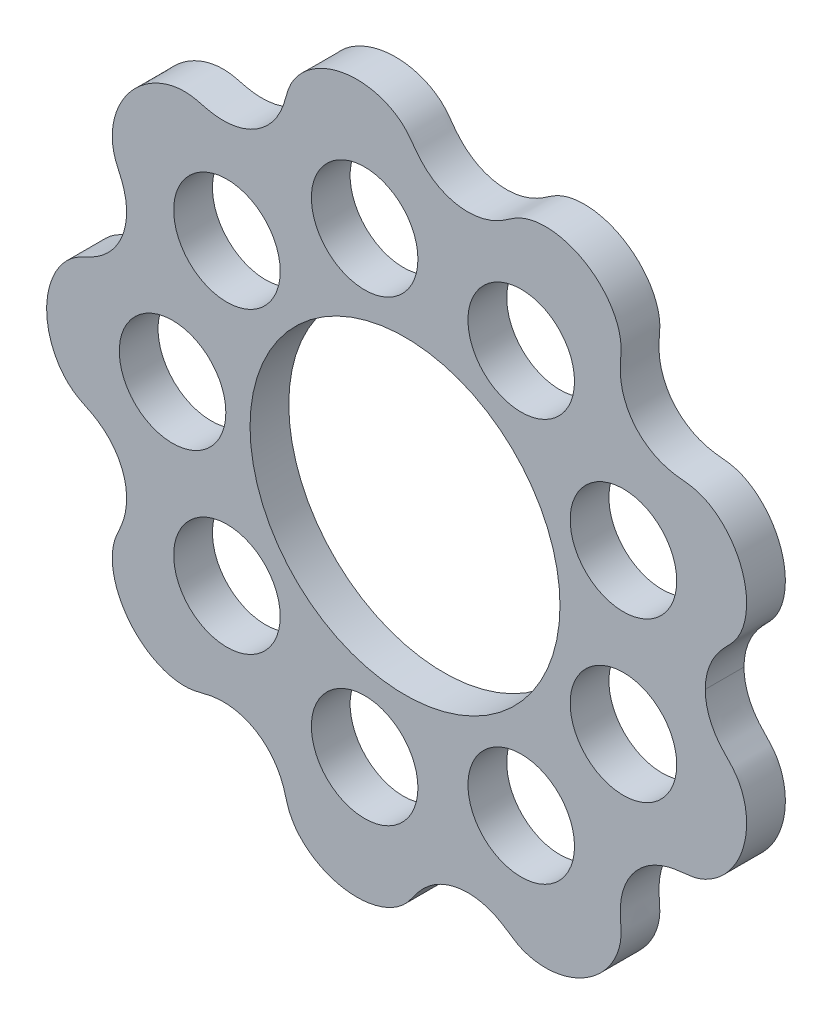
from build123d import *

# Parameters (mm, degrees)
BOSS_EXTRUDE1_DEPTH = 12.7
SKETCH2_R           = 101.6127
SKETCH2_R_2         = 34.925
CUT_EXTRUDE1_DEPTH  = 332.298667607


with BuildPart() as part:
    # Sketch1 → Boss-Extrude1 (new, symmetric)
    with BuildSketch(Plane.XY):
        with BuildLine():
            add(Edge.make_bspline(
                [(196.85000103, 0), (196.850001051, -0.046039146), (196.852222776, -1.512943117), (196.995909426, -4.400396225), (197.618960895, -8.675591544), (199.214953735, -14.144281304), (201.436535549, -19.105433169), (204.121217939, -23.525471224), (206.757870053, -26.958499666), (209.077423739, -29.560459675), (211.092774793, -31.650617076), (212.721954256, -33.306011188), (214.404150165, -35.088807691), (216.060981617, -37.067492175), (217.629453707, -39.277126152), (219.072825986, -41.719892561), (220.364838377, -44.361114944), (221.487205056, -47.190189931), (222.664010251, -50.970777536), (223.602165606, -55.549875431), (224.087110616, -60.811877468), (223.921999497, -66.698037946), (223.13999542, -72.325311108), (221.757628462, -77.843299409), (219.794894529, -83.19043027), (217.271233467, -88.305461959), (214.206353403, -93.125172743), (210.504320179, -97.729096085), (206.714378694, -101.425642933), (203.027640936, -104.299747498), (199.680219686, -106.408116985), (196.985140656, -107.830553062), (194.277062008, -108.999523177), (191.576680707, -109.917517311), (188.918777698, -110.576327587), (186.330507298, -111.002411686), (183.243105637, -111.3367641), (179.669117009, -111.664277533), (176.111995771, -112.171948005), (172.605356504, -112.954650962), (168.942274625, -114.042132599), (165.157269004, -115.498760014), (160.806658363, -117.741293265), (156.126056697, -121.042339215), (151.966710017, -124.951893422), (148.407198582, -129.388969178), (145.51103413, -134.25723107), (143.319881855, -139.454904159), (141.915943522, -144.657877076), (141.197922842, -149.74161015), (141.055999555, -154.042391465), (141.187629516, -157.511769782), (141.39855003, -160.396104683), (141.578839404, -162.702602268), (141.699883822, -165.137580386), (141.664613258, -167.700425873), (141.414252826, -170.376223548), (140.923371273, -173.143814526), (140.191768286, -175.975447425), (139.209293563, -178.85109158), (137.646201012, -182.500357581), (135.386029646, -186.595401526), (132.350457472, -190.902205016), (128.432805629, -195.2533265), (124.237150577, -199.000537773), (119.625722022, -202.311858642), (114.643228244, -205.140711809), (109.337063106, -207.438263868), (103.759619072, -209.152059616), (97.915750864, -210.243192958), (92.654041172, -210.576006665), (88.065239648, -210.360710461), (84.244936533, -209.80600014), (81.295093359, -209.147047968), (78.45828108, -208.274419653), (75.753329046, -207.192052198), (73.27402234, -205.940361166), (71.020299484, -204.567040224), (68.949609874, -203.164574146), (67.000408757, -201.826373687), (65.024474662, -200.527294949), (63.003869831, -199.298259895), (60.413774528, -197.872498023), (56.950969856, -196.247537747), (52.524985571, -194.669432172), (47.078229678, -193.488964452), (41.241957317, -193.068438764), (35.472845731, -193.4810331), (29.887183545, -194.689911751), (24.592101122, -196.636786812), (19.673658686, -199.248451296), (15.344976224, -202.348523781), (11.605509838, -205.781955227), (8.788513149, -208.975293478), (6.69499513, -211.704553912), (5.023606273, -214.031937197), (3.688079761, -215.895000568), (2.218248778, -217.8086772), (0.547121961, -219.713724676), (-1.354788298, -221.565646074), (-3.492071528, -223.33411665), (-6.465692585, -225.436027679), (-10.396610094, -227.657291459), (-15.209727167, -229.66474607), (-20.907566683, -231.219963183), (-26.572837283, -232.075047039), (-32.122703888, -232.308629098), (-37.679181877, -231.957730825), (-43.181983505, -231.028778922), (-48.570850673, -229.527800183), (-53.783476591, -227.460747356), (-58.944429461, -224.735242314), (-63.937483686, -221.286781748), (-67.916556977, -217.678658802), (-70.960921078, -214.144706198), (-73.089809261, -211.082457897), (-74.508187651, -208.666399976), (-75.671506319, -206.253324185), (-76.59512018, -203.871074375), (-77.32404683, -201.552464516), (-77.944504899, -199.33101765), (-78.725284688, -196.555650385), (-79.770711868, -193.25624843), (-81.347163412, -189.267084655), (-83.722345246, -184.734207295), (-86.778183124, -180.31666964), (-90.568961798, -176.164576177), (-94.925849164, -172.541671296), (-99.782095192, -169.536998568), (-105.049141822, -167.229418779), (-110.626794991, -165.678711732), (-116.096779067, -164.956543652), (-120.751060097, -164.939869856), (-124.526704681, -165.286867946), (-127.425240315, -165.741049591), (-129.726184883, -166.203169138), (-132.009439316, -166.74468554), (-134.281244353, -167.330960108), (-136.686197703, -167.935329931), (-139.249508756, -168.451876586), (-141.97957417, -168.781348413), (-144.860848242, -168.879485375), (-147.832687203, -168.7382657), (-150.875659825, -168.35005899), (-154.766432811, -167.543813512), (-159.248821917, -166.131164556), (-164.123762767, -163.970580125), (-169.2374328, -160.911658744), (-173.828925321, -157.41204928), (-177.995538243, -153.447575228), (-181.699351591, -149.076023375), (-184.904191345, -144.352373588), (-187.574018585, -139.33075548), (-189.732868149, -133.902900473), (-191.072024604, -128.868430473), (-191.76501325, -124.34917411), (-191.981321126, -120.497913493), (-191.928744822, -117.504503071), (-191.657191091, -114.599860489), (-191.173278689, -111.800386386), (-190.490617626, -109.172847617), (-189.640990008, -106.728902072), (-188.686125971, -104.462523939), (-187.719898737, -102.340207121), (-186.526313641, -99.680754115), (-185.208429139, -96.438881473), (-183.866314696, -92.310337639), (-182.80738555, -87.236912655), (-182.366190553, -81.810721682), (-182.684461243, -76.117564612), (-183.794267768, -70.502413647), (-185.688687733, -65.078420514), (-188.337081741, -59.961444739), (-191.688985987, -55.255656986), (-195.477371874, -51.255591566), (-199.075858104, -48.311628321), (-202.221888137, -46.197959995), (-204.7560087, -44.715268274), (-206.829796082, -43.612974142), (-208.936590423, -42.57582629), (-211.056835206, -41.56729591), (-213.277741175, -40.463466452), (-215.54763616, -39.168191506), (-217.815527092, -37.619330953), (-220.045450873, -35.800549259), (-222.16976175, -33.764127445), (-224.174368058, -31.521442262), (-226.523998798, -28.461264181), (-228.950876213, -24.574502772), (-231.226758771, -19.85416145), (-233.132309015, -14.277928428), (-234.375362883, -8.652496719), (-234.844405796, -4.346077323), (-234.949590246, -1.460038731), (-234.950000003, -0.011331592), (-234.950000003, 0)],
                knots=[0.122725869, 0.122725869, 0.122725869, 0.122725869, 0.122725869, 0.122903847, 0.128396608, 0.133889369, 0.139372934, 0.144856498, 0.14934603, 0.153835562, 0.156080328, 0.158325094, 0.160569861, 0.162814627, 0.165553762, 0.168292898, 0.171032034, 0.17377117, 0.176909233, 0.180047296, 0.186323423, 0.191803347, 0.197283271, 0.202763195, 0.208243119, 0.21375214, 0.21926116, 0.22477018, 0.2302792, 0.236541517, 0.239672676, 0.242803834, 0.245557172, 0.24831051, 0.251063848, 0.253817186, 0.256129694, 0.258442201, 0.263067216, 0.267692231, 0.270004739, 0.272317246, 0.27783198, 0.283346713, 0.288866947, 0.294387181, 0.2998262, 0.30526522, 0.310695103, 0.316124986, 0.320596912, 0.325068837, 0.3273048, 0.329540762, 0.331776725, 0.334012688, 0.336726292, 0.339439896, 0.3421535, 0.344867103, 0.348021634, 0.351176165, 0.357485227, 0.362911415, 0.368337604, 0.373763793, 0.379189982, 0.384817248, 0.390444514, 0.39607178, 0.401699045, 0.407747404, 0.410771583, 0.413795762, 0.416608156, 0.419420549, 0.422232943, 0.425045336, 0.427330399, 0.429615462, 0.431900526, 0.434185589, 0.436470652, 0.438755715, 0.443325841, 0.448958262, 0.454590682, 0.460230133, 0.465869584, 0.471240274, 0.476610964, 0.481971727, 0.487332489, 0.491763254, 0.49619402, 0.498409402, 0.500624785, 0.502840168, 0.505055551, 0.507733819, 0.510412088, 0.513090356, 0.515768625, 0.521798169, 0.527827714, 0.53318598, 0.538544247, 0.543902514, 0.54926078, 0.554669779, 0.560078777, 0.565487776, 0.570896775, 0.577186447, 0.583476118, 0.586180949, 0.58888578, 0.59159061, 0.594295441, 0.596524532, 0.598753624, 0.600982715, 0.603211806, 0.607669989, 0.612128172, 0.617539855, 0.622951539, 0.628373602, 0.633795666, 0.639375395, 0.644955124, 0.650528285, 0.656101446, 0.660636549, 0.662904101, 0.665171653, 0.667439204, 0.669706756, 0.671974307, 0.674241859, 0.677024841, 0.679807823, 0.682590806, 0.685373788, 0.688514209, 0.69165463, 0.697935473, 0.703503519, 0.709071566, 0.714639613, 0.72020766, 0.725693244, 0.731178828, 0.736664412, 0.742149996, 0.748227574, 0.751266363, 0.754305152, 0.757047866, 0.75979058, 0.762533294, 0.765276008, 0.767529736, 0.769783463, 0.77203719, 0.774290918, 0.778798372, 0.783305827, 0.78879334, 0.794280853, 0.799779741, 0.80527863, 0.810847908, 0.816417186, 0.821978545, 0.827539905, 0.832078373, 0.834347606, 0.83661684, 0.838886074, 0.841155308, 0.843424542, 0.845693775, 0.84847169, 0.851249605, 0.85402752, 0.856805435, 0.859836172, 0.86286691, 0.868928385, 0.874484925, 0.880041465, 0.885598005, 0.891154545, 0.891198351, 0.891198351, 0.891198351, 0.891198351, 0.891198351], degree=4))
            add(Edge.make_bspline(
                [(196.85000103, 0), (196.850001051, 0.046039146), (196.852222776, 1.512943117), (196.995909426, 4.400396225), (197.618960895, 8.675591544), (199.214953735, 14.144281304), (201.436535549, 19.105433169), (204.121217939, 23.525471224), (206.757870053, 26.958499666), (209.077423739, 29.560459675), (211.092774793, 31.650617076), (212.721954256, 33.306011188), (214.404150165, 35.088807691), (216.060981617, 37.067492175), (217.629453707, 39.277126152), (219.072825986, 41.719892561), (220.364838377, 44.361114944), (221.487205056, 47.190189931), (222.664010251, 50.970777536), (223.602165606, 55.549875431), (224.087110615, 60.811877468), (223.921999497, 66.698037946), (223.13999542, 72.325311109), (221.757628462, 77.843299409), (219.794894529, 83.19043027), (217.271233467, 88.305461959), (214.206353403, 93.125172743), (210.504320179, 97.729096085), (206.714378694, 101.425642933), (203.027640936, 104.299747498), (199.680219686, 106.408116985), (196.985140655, 107.830553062), (194.277062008, 108.999523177), (191.576680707, 109.917517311), (188.918777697, 110.576327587), (186.330507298, 111.002411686), (183.243105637, 111.3367641), (179.669117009, 111.664277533), (176.111995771, 112.171948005), (172.605356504, 112.954650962), (168.942274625, 114.042132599), (165.157269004, 115.498760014), (160.806658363, 117.741293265), (156.126056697, 121.042339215), (151.966710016, 124.951893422), (148.407198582, 129.388969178), (145.51103413, 134.25723107), (143.319881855, 139.454904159), (141.915943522, 144.657877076), (141.197922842, 149.74161015), (141.055999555, 154.042391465), (141.187629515, 157.511769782), (141.39855003, 160.396104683), (141.578839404, 162.702602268), (141.699883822, 165.137580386), (141.664613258, 167.700425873), (141.414252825, 170.376223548), (140.923371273, 173.143814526), (140.191768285, 175.975447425), (139.209293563, 178.851091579), (137.646201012, 182.500357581), (135.386029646, 186.595401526), (132.350457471, 190.902205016), (128.432805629, 195.2533265), (124.237150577, 199.000537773), (119.625722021, 202.311858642), (114.643228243, 205.140711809), (109.337063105, 207.438263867), (103.759619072, 209.152059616), (97.915750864, 210.243192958), (92.654041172, 210.576006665), (88.065239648, 210.360710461), (84.244936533, 209.80600014), (81.295093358, 209.147047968), (78.45828108, 208.274419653), (75.753329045, 207.192052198), (73.27402234, 205.940361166), (71.020299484, 204.567040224), (68.949609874, 203.164574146), (67.000408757, 201.826373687), (65.024474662, 200.527294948), (63.00386983, 199.298259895), (60.413774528, 197.872498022), (56.950969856, 196.247537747), (52.524985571, 194.669432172), (47.078229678, 193.488964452), (41.241957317, 193.068438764), (35.472845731, 193.4810331), (29.887183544, 194.689911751), (24.592101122, 196.636786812), (19.673658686, 199.248451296), (15.344976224, 202.34852378), (11.605509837, 205.781955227), (8.788513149, 208.975293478), (6.694995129, 211.704553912), (5.023606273, 214.031937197), (3.688079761, 215.895000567), (2.218248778, 217.8086772), (0.54712196, 219.713724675), (-1.354788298, 221.565646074), (-3.492071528, 223.33411665), (-6.465692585, 225.436027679), (-10.396610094, 227.657291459), (-15.209727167, 229.66474607), (-20.907566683, 231.219963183), (-26.572837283, 232.075047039), (-32.122703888, 232.308629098), (-37.679181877, 231.957730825), (-43.181983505, 231.028778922), (-48.570850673, 229.527800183), (-53.783476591, 227.460747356), (-58.944429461, 224.735242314), (-63.937483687, 221.286781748), (-67.916556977, 217.678658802), (-70.960921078, 214.144706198), (-73.089809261, 211.082457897), (-74.508187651, 208.666399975), (-75.671506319, 206.253324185), (-76.59512018, 203.871074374), (-77.32404683, 201.552464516), (-77.9445049, 199.331017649), (-78.725284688, 196.555650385), (-79.770711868, 193.25624843), (-81.347163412, 189.267084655), (-83.722345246, 184.734207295), (-86.778183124, 180.31666964), (-90.568961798, 176.164576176), (-94.925849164, 172.541671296), (-99.782095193, 169.536998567), (-105.049141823, 167.229418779), (-110.626794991, 165.678711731), (-116.096779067, 164.956543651), (-120.751060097, 164.939869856), (-124.526704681, 165.286867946), (-127.425240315, 165.741049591), (-129.726184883, 166.203169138), (-132.009439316, 166.74468554), (-134.281244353, 167.330960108), (-136.686197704, 167.935329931), (-139.249508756, 168.451876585), (-141.97957417, 168.781348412), (-144.860848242, 168.879485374), (-147.832687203, 168.738265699), (-150.875659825, 168.35005899), (-154.766432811, 167.543813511), (-159.248821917, 166.131164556), (-164.123762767, 163.970580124), (-169.2374328, 160.911658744), (-173.828925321, 157.41204928), (-177.995538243, 153.447575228), (-181.699351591, 149.076023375), (-184.904191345, 144.352373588), (-187.574018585, 139.33075548), (-189.732868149, 133.902900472), (-191.072024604, 128.868430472), (-191.76501325, 124.349174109), (-191.981321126, 120.497913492), (-191.928744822, 117.504503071), (-191.657191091, 114.599860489), (-191.173278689, 111.800386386), (-190.490617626, 109.172847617), (-189.640990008, 106.728902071), (-188.686125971, 104.462523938), (-187.719898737, 102.340207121), (-186.526313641, 99.680754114), (-185.208429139, 96.438881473), (-183.866314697, 92.310337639), (-182.80738555, 87.236912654), (-182.366190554, 81.810721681), (-182.684461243, 76.117564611), (-183.794267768, 70.502413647), (-185.688687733, 65.078420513), (-188.337081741, 59.961444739), (-191.688985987, 55.255656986), (-195.477371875, 51.255591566), (-199.075858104, 48.31162832), (-202.221888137, 46.197959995), (-204.7560087, 44.715268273), (-206.829796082, 43.612974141), (-208.936590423, 42.575826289), (-211.056835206, 41.567295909), (-213.277741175, 40.463466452), (-215.54763616, 39.168191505), (-217.815527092, 37.619330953), (-220.045450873, 35.800549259), (-222.16976175, 33.764127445), (-224.174368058, 31.521442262), (-226.523998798, 28.461264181), (-228.950876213, 24.574502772), (-231.226758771, 19.85416145), (-233.132309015, 14.277928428), (-234.375362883, 8.652496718), (-234.844405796, 4.346077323), (-234.949590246, 1.46003873), (-234.950000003, 0.011331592), (-234.950000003, 0)],
                knots=[0.122725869, 0.122725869, 0.122725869, 0.122725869, 0.122725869, 0.122903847, 0.128396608, 0.133889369, 0.139372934, 0.144856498, 0.14934603, 0.153835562, 0.156080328, 0.158325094, 0.160569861, 0.162814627, 0.165553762, 0.168292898, 0.171032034, 0.17377117, 0.176909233, 0.180047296, 0.186323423, 0.191803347, 0.197283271, 0.202763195, 0.208243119, 0.21375214, 0.21926116, 0.22477018, 0.2302792, 0.236541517, 0.239672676, 0.242803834, 0.245557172, 0.24831051, 0.251063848, 0.253817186, 0.256129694, 0.258442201, 0.263067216, 0.267692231, 0.270004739, 0.272317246, 0.27783198, 0.283346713, 0.288866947, 0.294387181, 0.2998262, 0.30526522, 0.310695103, 0.316124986, 0.320596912, 0.325068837, 0.3273048, 0.329540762, 0.331776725, 0.334012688, 0.336726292, 0.339439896, 0.3421535, 0.344867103, 0.348021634, 0.351176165, 0.357485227, 0.362911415, 0.368337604, 0.373763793, 0.379189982, 0.384817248, 0.390444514, 0.39607178, 0.401699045, 0.407747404, 0.410771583, 0.413795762, 0.416608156, 0.419420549, 0.422232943, 0.425045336, 0.427330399, 0.429615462, 0.431900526, 0.434185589, 0.436470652, 0.438755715, 0.443325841, 0.448958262, 0.454590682, 0.460230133, 0.465869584, 0.471240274, 0.476610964, 0.481971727, 0.487332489, 0.491763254, 0.49619402, 0.498409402, 0.500624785, 0.502840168, 0.505055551, 0.507733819, 0.510412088, 0.513090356, 0.515768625, 0.521798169, 0.527827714, 0.53318598, 0.538544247, 0.543902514, 0.54926078, 0.554669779, 0.560078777, 0.565487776, 0.570896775, 0.577186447, 0.583476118, 0.586180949, 0.58888578, 0.59159061, 0.594295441, 0.596524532, 0.598753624, 0.600982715, 0.603211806, 0.607669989, 0.612128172, 0.617539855, 0.622951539, 0.628373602, 0.633795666, 0.639375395, 0.644955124, 0.650528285, 0.656101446, 0.660636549, 0.662904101, 0.665171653, 0.667439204, 0.669706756, 0.671974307, 0.674241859, 0.677024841, 0.679807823, 0.682590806, 0.685373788, 0.688514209, 0.69165463, 0.697935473, 0.703503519, 0.709071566, 0.714639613, 0.72020766, 0.725693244, 0.731178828, 0.736664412, 0.742149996, 0.748227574, 0.751266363, 0.754305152, 0.757047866, 0.75979058, 0.762533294, 0.765276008, 0.767529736, 0.769783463, 0.77203719, 0.774290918, 0.778798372, 0.783305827, 0.78879334, 0.794280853, 0.799779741, 0.80527863, 0.810847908, 0.816417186, 0.821978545, 0.827539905, 0.832078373, 0.834347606, 0.83661684, 0.838886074, 0.841155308, 0.843424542, 0.845693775, 0.84847169, 0.851249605, 0.85402752, 0.856805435, 0.859836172, 0.86286691, 0.868928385, 0.874484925, 0.880041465, 0.885598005, 0.891154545, 0.891198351, 0.891198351, 0.891198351, 0.891198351, 0.891198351], degree=4))
        make_face()
    extrude(amount=BOSS_EXTRUDE1_DEPTH, both=True)

    # Sketch2 → Cut-Extrude1 (cut, through all)
    with BuildSketch(Plane.XY.offset(12.7)):
        Circle(SKETCH2_R)
        with Locations((-152.4, 0)):
            Circle(SKETCH2_R_2)
        with Locations((-116.745173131, 97.960831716)):
            Circle(SKETCH2_R_2)
        with Locations((-26.463982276, 150.084701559)):
            Circle(SKETCH2_R_2)
        with Locations((76.2, 131.982271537)):
            Circle(SKETCH2_R_2)
        with Locations((143.209155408, 52.123869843)):
            Circle(SKETCH2_R_2)
        with Locations((143.209155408, -52.123869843)):
            Circle(SKETCH2_R_2)
        with Locations((76.2, -131.982271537)):
            Circle(SKETCH2_R_2)
        with Locations((-26.463982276, -150.084701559)):
            Circle(SKETCH2_R_2)
        with Locations((-116.745173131, -97.960831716)):
            Circle(SKETCH2_R_2)
    extrude(amount=-CUT_EXTRUDE1_DEPTH, mode=Mode.SUBTRACT)


solid = part.part
